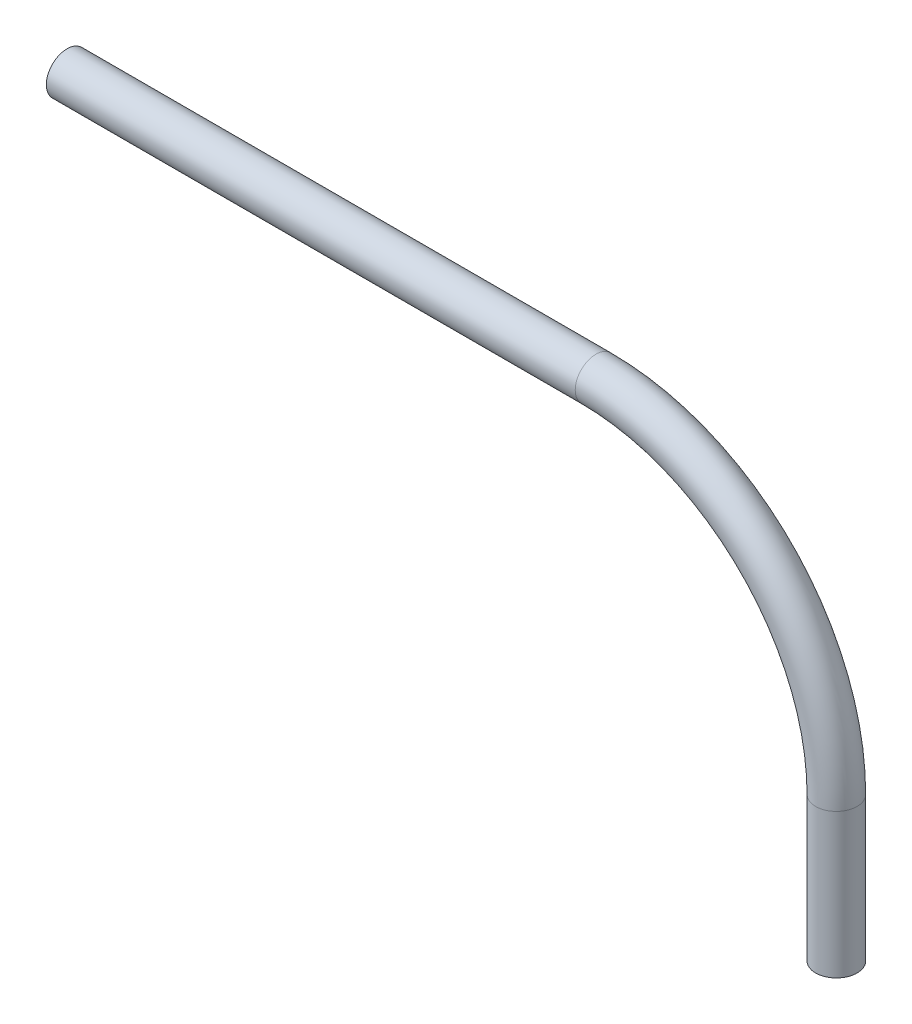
ISO-10303-21;
HEADER;
FILE_DESCRIPTION(('STEP AP214'),'2;1');
FILE_NAME('part.step','',(''),(''),'','','');
FILE_SCHEMA(('AUTOMOTIVE_DESIGN { 1 0 10303 214 1 1 1 1 }'));
ENDSEC;
DATA;
#1=APPLICATION_CONTEXT('core data for automotive mechanical design processes');
#2=APPLICATION_PROTOCOL_DEFINITION('international standard','automotive_design',2000,#1);
#3=PRODUCT_CONTEXT('',#1,'mechanical');
#4=PRODUCT('Part','Part','',(#3));
#5=PRODUCT_RELATED_PRODUCT_CATEGORY('part','',(#4));
#6=PRODUCT_DEFINITION_FORMATION('','',#4);
#7=PRODUCT_DEFINITION_CONTEXT('part definition',#1,'design');
#8=PRODUCT_DEFINITION('design','',#6,#7);
#9=PRODUCT_DEFINITION_SHAPE('','',#8);
#10=(LENGTH_UNIT() NAMED_UNIT(*) SI_UNIT(.MILLI.,.METRE.));
#11=(NAMED_UNIT(*) PLANE_ANGLE_UNIT() SI_UNIT($,.RADIAN.));
#12=(NAMED_UNIT(*) SI_UNIT($,.STERADIAN.) SOLID_ANGLE_UNIT());
#13=UNCERTAINTY_MEASURE_WITH_UNIT(LENGTH_MEASURE(1.E-05),#10,'distance_accuracy_value','');
#14=(GEOMETRIC_REPRESENTATION_CONTEXT(3) GLOBAL_UNCERTAINTY_ASSIGNED_CONTEXT((#13)) GLOBAL_UNIT_ASSIGNED_CONTEXT((#10,
#11,#12)) REPRESENTATION_CONTEXT('',''));
#15=CARTESIAN_POINT('',(0.,0.,0.));
#16=DIRECTION('',(0.,0.,1.));
#17=DIRECTION('',(1.,0.,0.));
#18=AXIS2_PLACEMENT_3D('',#15,#16,#17);
#19=CARTESIAN_POINT('',(640.,-320.,0.));
#20=DIRECTION('',(0.,1.,0.));
#21=DIRECTION('',(-1.,0.,0.));
#22=AXIS2_PLACEMENT_3D('',#19,#20,#21);
#23=CYLINDRICAL_SURFACE('',#22,14.5);
#24=CARTESIAN_POINT('',(640.,-320.,0.));
#25=DIRECTION('',(0.,1.,0.));
#26=DIRECTION('',(-1.,0.,0.));
#27=AXIS2_PLACEMENT_3D('',#24,#25,#26);
#28=CIRCLE('',#27,14.5);
#29=CARTESIAN_POINT('',(625.5,-320.,0.));
#30=VERTEX_POINT('',#29);
#31=EDGE_CURVE('E18',#30,#30,#28,.T.);
#32=ORIENTED_EDGE('',*,*,#31,.F.);
#33=EDGE_LOOP('',(#32));
#34=FACE_BOUND('',#33,.T.);
#35=CARTESIAN_POINT('',(640.,-200.,0.));
#36=DIRECTION('',(0.,1.,0.));
#37=DIRECTION('',(1.,0.,0.));
#38=AXIS2_PLACEMENT_3D('',#35,#36,#37);
#39=CIRCLE('',#38,14.5);
#40=CARTESIAN_POINT('',(654.5,-200.,0.));
#41=VERTEX_POINT('',#40);
#42=EDGE_CURVE('E66',#41,#41,#39,.T.);
#43=ORIENTED_EDGE('',*,*,#42,.T.);
#44=EDGE_LOOP('',(#43));
#45=FACE_BOUND('',#44,.T.);
#46=ADVANCED_FACE('F15',(#34,#45),#23,.F.);
#47=CARTESIAN_POINT('',(440.,-200.,0.));
#48=DIRECTION('',(0.,0.,1.));
#49=DIRECTION('',(1.,0.,0.));
#50=AXIS2_PLACEMENT_3D('',#47,#48,#49);
#51=TOROIDAL_SURFACE('',#50,200.,14.5);
#52=ORIENTED_EDGE('',*,*,#42,.F.);
#53=EDGE_LOOP('',(#52));
#54=FACE_BOUND('',#53,.T.);
#55=CARTESIAN_POINT('',(440.,0.,0.));
#56=DIRECTION('',(-1.,0.,0.));
#57=DIRECTION('',(0.,0.,1.));
#58=AXIS2_PLACEMENT_3D('',#55,#56,#57);
#59=CIRCLE('',#58,14.5);
#60=CARTESIAN_POINT('',(440.,0.,14.5));
#61=VERTEX_POINT('',#60);
#62=EDGE_CURVE('E75',#61,#61,#59,.T.);
#63=ORIENTED_EDGE('',*,*,#62,.T.);
#64=EDGE_LOOP('',(#63));
#65=FACE_BOUND('',#64,.T.);
#66=ADVANCED_FACE('F56',(#54,#65),#51,.F.);
#67=CARTESIAN_POINT('',(640.,-320.,0.));
#68=DIRECTION('',(0.,-1.,0.));
#69=DIRECTION('',(1.,0.,0.));
#70=AXIS2_PLACEMENT_3D('',#67,#68,#69);
#71=PLANE('',#70);
#72=CARTESIAN_POINT('',(640.,-320.,0.));
#73=DIRECTION('',(0.,1.,0.));
#74=DIRECTION('',(-1.,0.,0.));
#75=AXIS2_PLACEMENT_3D('',#72,#73,#74);
#76=CIRCLE('',#75,17.25);
#77=CARTESIAN_POINT('',(622.75,-320.,0.));
#78=VERTEX_POINT('',#77);
#79=EDGE_CURVE('E73',#78,#78,#76,.T.);
#80=ORIENTED_EDGE('',*,*,#79,.F.);
#81=EDGE_LOOP('',(#80));
#82=FACE_BOUND('',#81,.T.);
#83=ORIENTED_EDGE('',*,*,#31,.T.);
#84=EDGE_LOOP('',(#83));
#85=FACE_BOUND('',#84,.T.);
#86=ADVANCED_FACE('F53',(#82,#85),#71,.T.);
#87=CARTESIAN_POINT('',(440.,0.,0.));
#88=DIRECTION('',(-1.,0.,0.));
#89=DIRECTION('',(0.,0.,1.));
#90=AXIS2_PLACEMENT_3D('',#87,#88,#89);
#91=CYLINDRICAL_SURFACE('',#90,14.5);
#92=ORIENTED_EDGE('',*,*,#62,.F.);
#93=EDGE_LOOP('',(#92));
#94=FACE_BOUND('',#93,.T.);
#95=CARTESIAN_POINT('',(0.,0.,0.));
#96=DIRECTION('',(-1.,0.,0.));
#97=DIRECTION('',(0.,0.,1.));
#98=AXIS2_PLACEMENT_3D('',#95,#96,#97);
#99=CIRCLE('',#98,14.5);
#100=CARTESIAN_POINT('',(0.,0.,14.5));
#101=VERTEX_POINT('',#100);
#102=EDGE_CURVE('E71',#101,#101,#99,.T.);
#103=ORIENTED_EDGE('',*,*,#102,.T.);
#104=EDGE_LOOP('',(#103));
#105=FACE_BOUND('',#104,.T.);
#106=ADVANCED_FACE('F49',(#94,#105),#91,.F.);
#107=CARTESIAN_POINT('',(640.,-320.,0.));
#108=DIRECTION('',(0.,1.,0.));
#109=DIRECTION('',(-1.,0.,0.));
#110=AXIS2_PLACEMENT_3D('',#107,#108,#109);
#111=CYLINDRICAL_SURFACE('',#110,17.25);
#112=ORIENTED_EDGE('',*,*,#79,.T.);
#113=EDGE_LOOP('',(#112));
#114=FACE_BOUND('',#113,.T.);
#115=CARTESIAN_POINT('',(640.,-200.,0.));
#116=DIRECTION('',(0.,1.,0.));
#117=DIRECTION('',(1.,0.,0.));
#118=AXIS2_PLACEMENT_3D('',#115,#116,#117);
#119=CIRCLE('',#118,17.25);
#120=CARTESIAN_POINT('',(657.25,-200.,0.));
#121=VERTEX_POINT('',#120);
#122=EDGE_CURVE('E27',#121,#121,#119,.T.);
#123=ORIENTED_EDGE('',*,*,#122,.F.);
#124=EDGE_LOOP('',(#123));
#125=FACE_BOUND('',#124,.T.);
#126=ADVANCED_FACE('F45',(#114,#125),#111,.T.);
#127=CARTESIAN_POINT('',(0.,0.,0.));
#128=DIRECTION('',(1.,0.,0.));
#129=DIRECTION('',(0.,0.,-1.));
#130=AXIS2_PLACEMENT_3D('',#127,#128,#129);
#131=PLANE('',#130);
#132=CARTESIAN_POINT('',(0.,0.,0.));
#133=DIRECTION('',(-1.,0.,0.));
#134=DIRECTION('',(0.,0.,1.));
#135=AXIS2_PLACEMENT_3D('',#132,#133,#134);
#136=CIRCLE('',#135,17.25);
#137=CARTESIAN_POINT('',(0.,0.,17.25));
#138=VERTEX_POINT('',#137);
#139=EDGE_CURVE('E22',#138,#138,#136,.F.);
#140=ORIENTED_EDGE('',*,*,#139,.F.);
#141=EDGE_LOOP('',(#140));
#142=FACE_BOUND('',#141,.T.);
#143=ORIENTED_EDGE('',*,*,#102,.F.);
#144=EDGE_LOOP('',(#143));
#145=FACE_BOUND('',#144,.T.);
#146=ADVANCED_FACE('F41',(#142,#145),#131,.F.);
#147=CARTESIAN_POINT('',(440.,-200.,0.));
#148=DIRECTION('',(0.,0.,1.));
#149=DIRECTION('',(1.,0.,0.));
#150=AXIS2_PLACEMENT_3D('',#147,#148,#149);
#151=TOROIDAL_SURFACE('',#150,200.,17.25);
#152=ORIENTED_EDGE('',*,*,#122,.T.);
#153=EDGE_LOOP('',(#152));
#154=FACE_BOUND('',#153,.T.);
#155=CARTESIAN_POINT('',(440.,0.,0.));
#156=DIRECTION('',(-1.,0.,0.));
#157=DIRECTION('',(0.,0.,1.));
#158=AXIS2_PLACEMENT_3D('',#155,#156,#157);
#159=CIRCLE('',#158,17.25);
#160=CARTESIAN_POINT('',(440.,0.,17.25));
#161=VERTEX_POINT('',#160);
#162=EDGE_CURVE('E10',#161,#161,#159,.T.);
#163=ORIENTED_EDGE('',*,*,#162,.F.);
#164=EDGE_LOOP('',(#163));
#165=FACE_BOUND('',#164,.T.);
#166=ADVANCED_FACE('F36',(#154,#165),#151,.T.);
#167=CARTESIAN_POINT('',(440.,0.,0.));
#168=DIRECTION('',(-1.,0.,0.));
#169=DIRECTION('',(0.,0.,1.));
#170=AXIS2_PLACEMENT_3D('',#167,#168,#169);
#171=CYLINDRICAL_SURFACE('',#170,17.25);
#172=ORIENTED_EDGE('',*,*,#162,.T.);
#173=EDGE_LOOP('',(#172));
#174=FACE_BOUND('',#173,.T.);
#175=ORIENTED_EDGE('',*,*,#139,.T.);
#176=EDGE_LOOP('',(#175));
#177=FACE_BOUND('',#176,.T.);
#178=ADVANCED_FACE('F40',(#174,#177),#171,.T.);
#179=CLOSED_SHELL('',(#46,#66,#86,#106,#126,#146,#166,#178));
#180=MANIFOLD_SOLID_BREP('B1',#179);
#181=ADVANCED_BREP_SHAPE_REPRESENTATION('',(#18,#180),#14);
#182=SHAPE_DEFINITION_REPRESENTATION(#9,#181);
ENDSEC;
END-ISO-10303-21;
